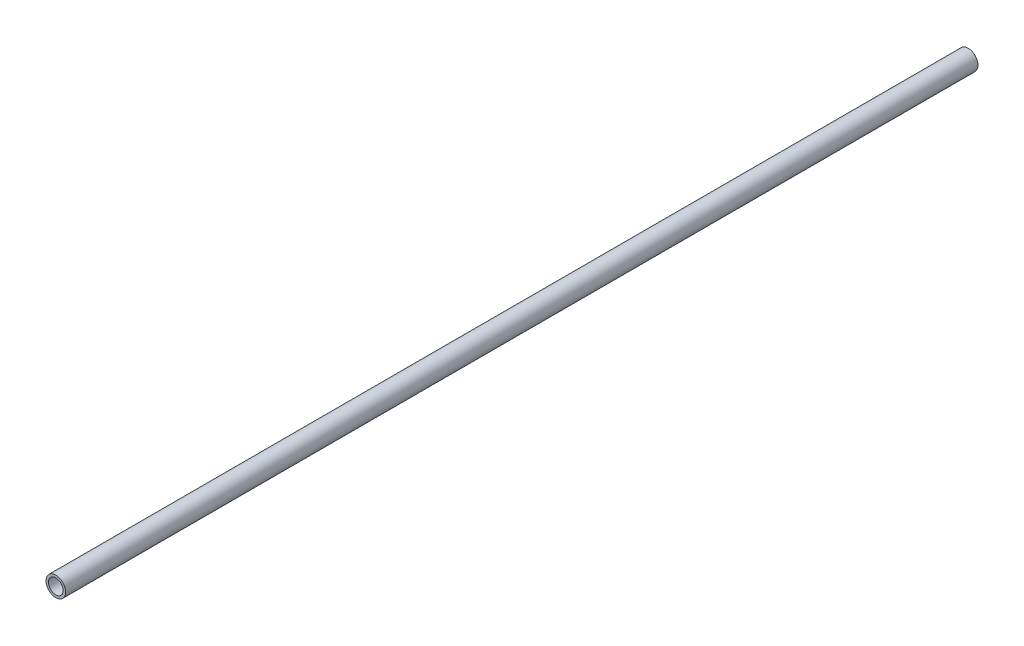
ISO-10303-21;
HEADER;
FILE_DESCRIPTION(('STEP AP214'),'2;1');
FILE_NAME('part.step','',(''),(''),'','','');
FILE_SCHEMA(('AUTOMOTIVE_DESIGN { 1 0 10303 214 1 1 1 1 }'));
ENDSEC;
DATA;
#1=APPLICATION_CONTEXT('core data for automotive mechanical design processes');
#2=APPLICATION_PROTOCOL_DEFINITION('international standard','automotive_design',2000,#1);
#3=PRODUCT_CONTEXT('',#1,'mechanical');
#4=PRODUCT('Part','Part','',(#3));
#5=PRODUCT_RELATED_PRODUCT_CATEGORY('part','',(#4));
#6=PRODUCT_DEFINITION_FORMATION('','',#4);
#7=PRODUCT_DEFINITION_CONTEXT('part definition',#1,'design');
#8=PRODUCT_DEFINITION('design','',#6,#7);
#9=PRODUCT_DEFINITION_SHAPE('','',#8);
#10=(LENGTH_UNIT() NAMED_UNIT(*) SI_UNIT(.MILLI.,.METRE.));
#11=(NAMED_UNIT(*) PLANE_ANGLE_UNIT() SI_UNIT($,.RADIAN.));
#12=(NAMED_UNIT(*) SI_UNIT($,.STERADIAN.) SOLID_ANGLE_UNIT());
#13=UNCERTAINTY_MEASURE_WITH_UNIT(LENGTH_MEASURE(1.E-05),#10,'distance_accuracy_value','');
#14=(GEOMETRIC_REPRESENTATION_CONTEXT(3) GLOBAL_UNCERTAINTY_ASSIGNED_CONTEXT((#13)) GLOBAL_UNIT_ASSIGNED_CONTEXT((#10,
#11,#12)) REPRESENTATION_CONTEXT('',''));
#15=CARTESIAN_POINT('',(0.,0.,0.));
#16=DIRECTION('',(0.,0.,1.));
#17=DIRECTION('',(1.,0.,0.));
#18=AXIS2_PLACEMENT_3D('',#15,#16,#17);
#19=CARTESIAN_POINT('',(0.,0.,590.55));
#20=DIRECTION('',(0.,0.,-1.));
#21=DIRECTION('',(-1.,0.,0.));
#22=AXIS2_PLACEMENT_3D('',#19,#20,#21);
#23=CYLINDRICAL_SURFACE('',#22,6.35);
#24=CARTESIAN_POINT('',(0.,0.,590.55));
#25=DIRECTION('',(0.,0.,1.));
#26=DIRECTION('',(1.,0.,0.));
#27=AXIS2_PLACEMENT_3D('',#24,#25,#26);
#28=CIRCLE('',#27,6.35);
#29=CARTESIAN_POINT('',(6.35,0.,590.55));
#30=VERTEX_POINT('',#29);
#31=EDGE_CURVE('E10',#30,#30,#28,.T.);
#32=ORIENTED_EDGE('',*,*,#31,.F.);
#33=EDGE_LOOP('',(#32));
#34=FACE_BOUND('',#33,.T.);
#35=CARTESIAN_POINT('',(0.,0.,0.));
#36=DIRECTION('',(0.,0.,1.));
#37=DIRECTION('',(1.,0.,0.));
#38=AXIS2_PLACEMENT_3D('',#35,#36,#37);
#39=CIRCLE('',#38,6.35);
#40=CARTESIAN_POINT('',(6.35,0.,0.));
#41=VERTEX_POINT('',#40);
#42=EDGE_CURVE('E34',#41,#41,#39,.T.);
#43=ORIENTED_EDGE('',*,*,#42,.T.);
#44=EDGE_LOOP('',(#43));
#45=FACE_BOUND('',#44,.T.);
#46=ADVANCED_FACE('F31',(#34,#45),#23,.T.);
#47=CARTESIAN_POINT('',(0.,0.,590.55));
#48=DIRECTION('',(0.,0.,1.));
#49=DIRECTION('',(1.,0.,0.));
#50=AXIS2_PLACEMENT_3D('',#47,#48,#49);
#51=PLANE('',#50);
#52=CARTESIAN_POINT('',(0.,0.,590.55));
#53=DIRECTION('',(0.,0.,1.));
#54=DIRECTION('',(1.,0.,0.));
#55=AXIS2_PLACEMENT_3D('',#52,#53,#54);
#56=CIRCLE('',#55,4.7625);
#57=CARTESIAN_POINT('',(4.7625,0.,590.55));
#58=VERTEX_POINT('',#57);
#59=EDGE_CURVE('E41',#58,#58,#56,.T.);
#60=ORIENTED_EDGE('',*,*,#59,.F.);
#61=EDGE_LOOP('',(#60));
#62=FACE_BOUND('',#61,.T.);
#63=ORIENTED_EDGE('',*,*,#31,.T.);
#64=EDGE_LOOP('',(#63));
#65=FACE_BOUND('',#64,.T.);
#66=ADVANCED_FACE('F59',(#62,#65),#51,.T.);
#67=CARTESIAN_POINT('',(0.,0.,0.));
#68=DIRECTION('',(0.,0.,1.));
#69=DIRECTION('',(1.,0.,0.));
#70=AXIS2_PLACEMENT_3D('',#67,#68,#69);
#71=PLANE('',#70);
#72=CARTESIAN_POINT('',(0.,0.,0.));
#73=DIRECTION('',(0.,0.,1.));
#74=DIRECTION('',(1.,0.,0.));
#75=AXIS2_PLACEMENT_3D('',#72,#73,#74);
#76=CIRCLE('',#75,4.7625);
#77=CARTESIAN_POINT('',(4.7625,0.,0.));
#78=VERTEX_POINT('',#77);
#79=EDGE_CURVE('E45',#78,#78,#76,.T.);
#80=ORIENTED_EDGE('',*,*,#79,.T.);
#81=EDGE_LOOP('',(#80));
#82=FACE_BOUND('',#81,.T.);
#83=ORIENTED_EDGE('',*,*,#42,.F.);
#84=EDGE_LOOP('',(#83));
#85=FACE_BOUND('',#84,.T.);
#86=ADVANCED_FACE('F49',(#82,#85),#71,.F.);
#87=CARTESIAN_POINT('',(0.,0.,0.));
#88=DIRECTION('',(0.,0.,1.));
#89=DIRECTION('',(1.,0.,0.));
#90=AXIS2_PLACEMENT_3D('',#87,#88,#89);
#91=CYLINDRICAL_SURFACE('',#90,4.7625);
#92=ORIENTED_EDGE('',*,*,#59,.T.);
#93=EDGE_LOOP('',(#92));
#94=FACE_BOUND('',#93,.T.);
#95=ORIENTED_EDGE('',*,*,#79,.F.);
#96=EDGE_LOOP('',(#95));
#97=FACE_BOUND('',#96,.T.);
#98=ADVANCED_FACE('F52',(#94,#97),#91,.F.);
#99=CLOSED_SHELL('',(#46,#66,#86,#98));
#100=MANIFOLD_SOLID_BREP('B2',#99);
#101=ADVANCED_BREP_SHAPE_REPRESENTATION('',(#18,#100),#14);
#102=SHAPE_DEFINITION_REPRESENTATION(#9,#101);
ENDSEC;
END-ISO-10303-21;
